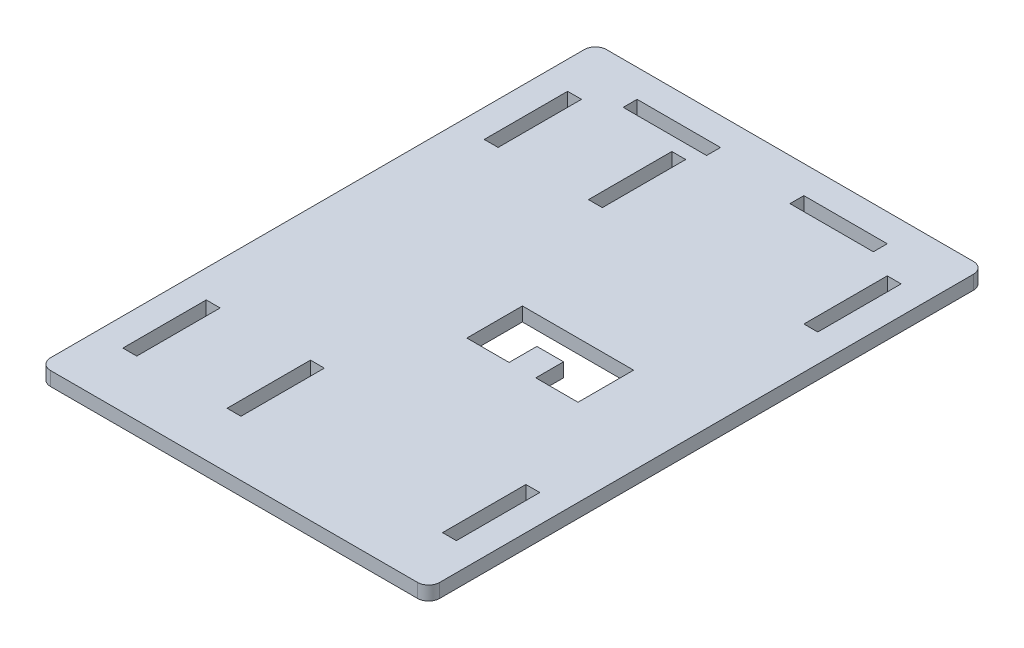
from build123d import *

# Parameters (mm, degrees)
SKETCH1_W           = 88.9
SKETCH1_H           = 127
BOSS_EXTRUDE1_DEPTH = 3.175
SKETCH2_W           = 3.175
SKETCH2_H           = 19.05
SKETCH2_W_2         = 19.05
SKETCH2_H_2         = 3.175
CUT_EXTRUDE1_DEPTH  = 156.055766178
FILLET1_R           = 2.54


with BuildPart() as part:
    # Sketch1 → Boss-Extrude1 (new body)
    with BuildSketch(Plane(origin=(0, 0, 0), x_dir=(1, 0, 0), z_dir=(0, 1, 0))):
        with Locations((44.45, 63.5)):
            Rectangle(SKETCH1_W, SKETCH1_H)
    extrude(amount=BOSS_EXTRUDE1_DEPTH)

    # Sketch2 → Cut-Extrude1 (cut, through all)
    with BuildSketch(Plane(origin=(0, 3.175, 0), x_dir=(1, 0, 0), z_dir=(0, 1, 0))):
        with Locations((7.9375, 104.775)):
            Rectangle(SKETCH2_W, SKETCH2_H)
        with Locations((80.9625, 104.775)):
            Rectangle(SKETCH2_W, SKETCH2_H)
        with Locations((80.9625, 22.225)):
            Rectangle(SKETCH2_W, SKETCH2_H)
        with Locations((7.9375, 22.225)):
            Rectangle(SKETCH2_W, SKETCH2_H)
        with Locations((63.5, 119.0625)):
            Rectangle(SKETCH2_W_2, SKETCH2_H_2)
        with Locations((25.4, 119.0625)):
            Rectangle(SKETCH2_W_2, SKETCH2_H_2)
        with Locations((31.75, 22.225)):
            Rectangle(SKETCH2_W, SKETCH2_H)
        with Locations((31.75, 104.775)):
            Rectangle(SKETCH2_W, SKETCH2_H)
        Polygon((69.05625, 66.675), (43.65625, 66.675), (43.65625, 53.975), (53.30825, 53.975), (53.30825, 60.325), (59.40425, 60.325), (59.40425, 53.975), (69.05625, 53.975), align=None)
    extrude(amount=-CUT_EXTRUDE1_DEPTH, mode=Mode.SUBTRACT)

    # Fillet1
    fillet1_edges = [part.edges().sort_by_distance(p)[0] for p in [
        (0, 1.5875, -127),
        (88.9, 1.5875, -127),
        (88.9, 1.5875, 0),
        (0, 1.5875, 0),
    ]]
    fillet(fillet1_edges, radius=FILLET1_R)


solid = part.part
